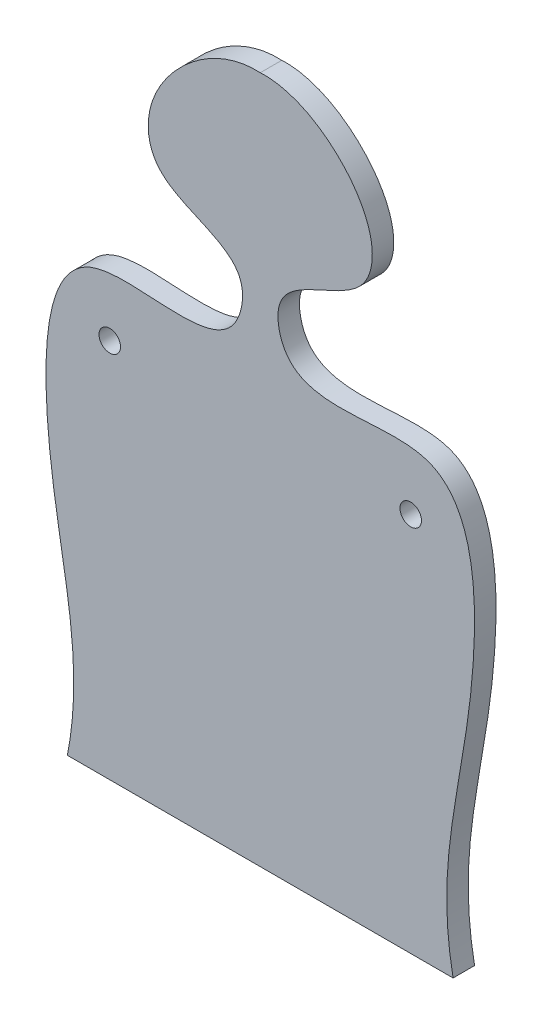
from build123d import *

# Parameters (mm, degrees)
SKETCH1_R           = 1.5875
BOSS_EXTRUDE1_DEPTH = 3.175


with BuildPart() as part:
    # Sketch1 → Boss-Extrude1 (new body)
    with BuildSketch(Plane.XY):
        with BuildLine():
            Line((28.49587751, 0), (-28.49587751, 0))
            add(Edge.make_bspline(
                [(0, 101.6), (-6.86377709, 102.016428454), (-17.572050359, 92.867229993), (-16.060902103, 78.487129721), (-1.210322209, 77.713728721), (-4.383361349, 60.603283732), (-30.895089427, 71.60364716), (-33.153977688, 31.636717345), (-25.512180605, 15.313063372), (-28.49587751, 0)],
                knots=[0, 0, 0, 0, 0.126396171, 0.183965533, 0.298787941, 0.340190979, 0.504457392, 0.675189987, 1, 1, 1, 1], degree=3))
            add(Edge.make_bspline(
                [(0, 101.6), (6.86377709, 102.016428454), (17.572050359, 92.867229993), (16.060902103, 78.487129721), (1.210322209, 77.713728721), (4.383361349, 60.603283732), (30.895089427, 71.60364716), (33.153977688, 31.636717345), (25.512180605, 15.313063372), (28.49587751, 0)],
                knots=[0, 0, 0, 0, 0.126396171, 0.183965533, 0.298787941, 0.340190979, 0.504457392, 0.675189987, 1, 1, 1, 1], degree=3))
        make_face()
        with Locations((-22.235813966, 56.194616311)):
            Circle(SKETCH1_R, mode=Mode.SUBTRACT)
        with Locations(Location((22.235813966, 56.194616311, 0), (0, 0, 180))):
            Circle(SKETCH1_R, mode=Mode.SUBTRACT)
    extrude(amount=BOSS_EXTRUDE1_DEPTH)


solid = part.part
